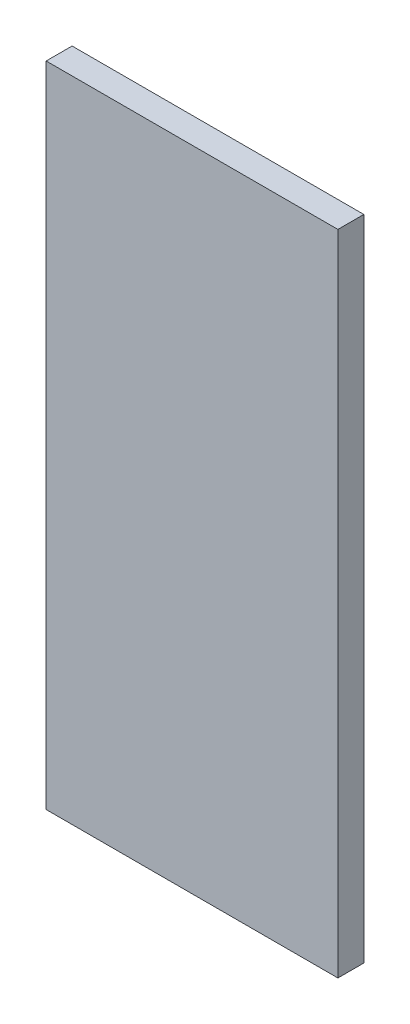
ISO-10303-21;
HEADER;
FILE_DESCRIPTION(('STEP AP214'),'2;1');
FILE_NAME('part.step','',(''),(''),'','','');
FILE_SCHEMA(('AUTOMOTIVE_DESIGN { 1 0 10303 214 1 1 1 1 }'));
ENDSEC;
DATA;
#1=APPLICATION_CONTEXT('core data for automotive mechanical design processes');
#2=APPLICATION_PROTOCOL_DEFINITION('international standard','automotive_design',2000,#1);
#3=PRODUCT_CONTEXT('',#1,'mechanical');
#4=PRODUCT('Part','Part','',(#3));
#5=PRODUCT_RELATED_PRODUCT_CATEGORY('part','',(#4));
#6=PRODUCT_DEFINITION_FORMATION('','',#4);
#7=PRODUCT_DEFINITION_CONTEXT('part definition',#1,'design');
#8=PRODUCT_DEFINITION('design','',#6,#7);
#9=PRODUCT_DEFINITION_SHAPE('','',#8);
#10=(LENGTH_UNIT() NAMED_UNIT(*) SI_UNIT(.MILLI.,.METRE.));
#11=(NAMED_UNIT(*) PLANE_ANGLE_UNIT() SI_UNIT($,.RADIAN.));
#12=(NAMED_UNIT(*) SI_UNIT($,.STERADIAN.) SOLID_ANGLE_UNIT());
#13=UNCERTAINTY_MEASURE_WITH_UNIT(LENGTH_MEASURE(1.E-05),#10,'distance_accuracy_value','');
#14=(GEOMETRIC_REPRESENTATION_CONTEXT(3) GLOBAL_UNCERTAINTY_ASSIGNED_CONTEXT((#13)) GLOBAL_UNIT_ASSIGNED_CONTEXT((#10,
#11,#12)) REPRESENTATION_CONTEXT('',''));
#15=CARTESIAN_POINT('',(0.,0.,0.));
#16=DIRECTION('',(0.,0.,1.));
#17=DIRECTION('',(1.,0.,0.));
#18=AXIS2_PLACEMENT_3D('',#15,#16,#17);
#19=CARTESIAN_POINT('',(-1.66533453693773E-13,2.22044604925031E-13,8.00000000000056));
#20=DIRECTION('',(1.,0.,0.));
#21=DIRECTION('',(0.,0.,-1.));
#22=AXIS2_PLACEMENT_3D('',#19,#20,#21);
#23=PLANE('',#22);
#24=DIRECTION('',(0.,-1.,0.));
#25=VECTOR('',#24,1.);
#26=CARTESIAN_POINT('',(-1.66533453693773E-13,0.,0.));
#27=LINE('',#26,#25);
#28=CARTESIAN_POINT('',(-1.66533453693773E-13,200.,0.));
#29=VERTEX_POINT('',#28);
#30=CARTESIAN_POINT('',(-1.66533453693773E-13,0.,0.));
#31=VERTEX_POINT('',#30);
#32=EDGE_CURVE('E85',#29,#31,#27,.T.);
#33=ORIENTED_EDGE('',*,*,#32,.T.);
#34=DIRECTION('',(0.,0.,-1.));
#35=VECTOR('',#34,1.);
#36=CARTESIAN_POINT('',(-1.66533453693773E-13,2.22044604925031E-13,8.00000000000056));
#37=LINE('',#36,#35);
#38=CARTESIAN_POINT('',(-1.66533453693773E-13,2.22044604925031E-13,8.00000000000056));
#39=VERTEX_POINT('',#38);
#40=EDGE_CURVE('E11',#39,#31,#37,.T.);
#41=ORIENTED_EDGE('',*,*,#40,.F.);
#42=DIRECTION('',(0.,-1.,0.));
#43=VECTOR('',#42,1.);
#44=CARTESIAN_POINT('',(-1.66533453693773E-13,2.22044604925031E-13,8.00000000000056));
#45=LINE('',#44,#43);
#46=CARTESIAN_POINT('',(-1.66533453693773E-13,200.,8.00000000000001));
#47=VERTEX_POINT('',#46);
#48=EDGE_CURVE('E103',#47,#39,#45,.T.);
#49=ORIENTED_EDGE('',*,*,#48,.F.);
#50=DIRECTION('',(0.,0.,-1.));
#51=VECTOR('',#50,1.);
#52=CARTESIAN_POINT('',(-1.66533453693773E-13,200.,8.00000000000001));
#53=LINE('',#52,#51);
#54=EDGE_CURVE('E97',#47,#29,#53,.T.);
#55=ORIENTED_EDGE('',*,*,#54,.T.);
#56=EDGE_LOOP('',(#33,#41,#49,#55));
#57=FACE_BOUND('',#56,.T.);
#58=ADVANCED_FACE('F41',(#57),#23,.F.);
#59=CARTESIAN_POINT('',(-1.66533453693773E-13,2.22044604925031E-13,8.00000000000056));
#60=DIRECTION('',(0.,1.,0.));
#61=DIRECTION('',(0.,0.,1.));
#62=AXIS2_PLACEMENT_3D('',#59,#60,#61);
#63=PLANE('',#62);
#64=DIRECTION('',(1.,0.,0.));
#65=VECTOR('',#64,1.);
#66=CARTESIAN_POINT('',(-1.66533453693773E-13,0.,0.));
#67=LINE('',#66,#65);
#68=CARTESIAN_POINT('',(90.,0.,0.));
#69=VERTEX_POINT('',#68);
#70=EDGE_CURVE('E81',#31,#69,#67,.T.);
#71=ORIENTED_EDGE('',*,*,#70,.T.);
#72=DIRECTION('',(0.,0.,-1.));
#73=VECTOR('',#72,1.);
#74=CARTESIAN_POINT('',(90.,1.38777878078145E-13,7.9999999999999));
#75=LINE('',#74,#73);
#76=CARTESIAN_POINT('',(90.,1.38777878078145E-13,7.9999999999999));
#77=VERTEX_POINT('',#76);
#78=EDGE_CURVE('E48',#77,#69,#75,.T.);
#79=ORIENTED_EDGE('',*,*,#78,.F.);
#80=DIRECTION('',(1.,0.,0.));
#81=VECTOR('',#80,1.);
#82=CARTESIAN_POINT('',(-1.66533453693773E-13,2.22044604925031E-13,8.00000000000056));
#83=LINE('',#82,#81);
#84=EDGE_CURVE('E93',#39,#77,#83,.T.);
#85=ORIENTED_EDGE('',*,*,#84,.F.);
#86=ORIENTED_EDGE('',*,*,#40,.T.);
#87=EDGE_LOOP('',(#71,#79,#85,#86));
#88=FACE_BOUND('',#87,.T.);
#89=ADVANCED_FACE('F92',(#88),#63,.F.);
#90=CARTESIAN_POINT('',(90.,1.38777878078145E-13,7.9999999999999));
#91=DIRECTION('',(-1.,0.,0.));
#92=DIRECTION('',(0.,0.,1.));
#93=AXIS2_PLACEMENT_3D('',#90,#91,#92);
#94=PLANE('',#93);
#95=DIRECTION('',(0.,1.,0.));
#96=VECTOR('',#95,1.);
#97=CARTESIAN_POINT('',(90.,0.,0.));
#98=LINE('',#97,#96);
#99=CARTESIAN_POINT('',(90.,200.,2.22044604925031E-13));
#100=VERTEX_POINT('',#99);
#101=EDGE_CURVE('E86',#69,#100,#98,.T.);
#102=ORIENTED_EDGE('',*,*,#101,.T.);
#103=DIRECTION('',(0.,0.,-1.));
#104=VECTOR('',#103,1.);
#105=CARTESIAN_POINT('',(90.,200.,8.00000000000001));
#106=LINE('',#105,#104);
#107=CARTESIAN_POINT('',(90.,200.,8.00000000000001));
#108=VERTEX_POINT('',#107);
#109=EDGE_CURVE('E109',#108,#100,#106,.T.);
#110=ORIENTED_EDGE('',*,*,#109,.F.);
#111=DIRECTION('',(0.,1.,0.));
#112=VECTOR('',#111,1.);
#113=CARTESIAN_POINT('',(90.,1.38777878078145E-13,7.9999999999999));
#114=LINE('',#113,#112);
#115=EDGE_CURVE('E60',#77,#108,#114,.T.);
#116=ORIENTED_EDGE('',*,*,#115,.F.);
#117=ORIENTED_EDGE('',*,*,#78,.T.);
#118=EDGE_LOOP('',(#102,#110,#116,#117));
#119=FACE_BOUND('',#118,.T.);
#120=ADVANCED_FACE('F112',(#119),#94,.F.);
#121=CARTESIAN_POINT('',(-1.66533453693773E-13,200.,8.00000000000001));
#122=DIRECTION('',(0.,-1.,0.));
#123=DIRECTION('',(0.,0.,-1.));
#124=AXIS2_PLACEMENT_3D('',#121,#122,#123);
#125=PLANE('',#124);
#126=DIRECTION('',(-1.,0.,0.));
#127=VECTOR('',#126,1.);
#128=CARTESIAN_POINT('',(-1.66533453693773E-13,200.,0.));
#129=LINE('',#128,#127);
#130=EDGE_CURVE('E101',#100,#29,#129,.T.);
#131=ORIENTED_EDGE('',*,*,#130,.T.);
#132=ORIENTED_EDGE('',*,*,#54,.F.);
#133=DIRECTION('',(-1.,0.,0.));
#134=VECTOR('',#133,1.);
#135=CARTESIAN_POINT('',(-1.66533453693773E-13,200.,8.00000000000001));
#136=LINE('',#135,#134);
#137=EDGE_CURVE('E55',#108,#47,#136,.T.);
#138=ORIENTED_EDGE('',*,*,#137,.F.);
#139=ORIENTED_EDGE('',*,*,#109,.T.);
#140=EDGE_LOOP('',(#131,#132,#138,#139));
#141=FACE_BOUND('',#140,.T.);
#142=ADVANCED_FACE('F114',(#141),#125,.F.);
#143=CARTESIAN_POINT('',(-1.66533453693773E-13,200.,8.00000000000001));
#144=DIRECTION('',(0.,0.,-1.));
#145=DIRECTION('',(-1.,0.,0.));
#146=AXIS2_PLACEMENT_3D('',#143,#144,#145);
#147=PLANE('',#146);
#148=ORIENTED_EDGE('',*,*,#48,.T.);
#149=ORIENTED_EDGE('',*,*,#84,.T.);
#150=ORIENTED_EDGE('',*,*,#115,.T.);
#151=ORIENTED_EDGE('',*,*,#137,.T.);
#152=EDGE_LOOP('',(#148,#149,#150,#151));
#153=FACE_BOUND('',#152,.T.);
#154=ADVANCED_FACE('F115',(#153),#147,.F.);
#155=CARTESIAN_POINT('',(-1.66533453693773E-13,200.,0.));
#156=DIRECTION('',(0.,0.,-1.));
#157=DIRECTION('',(-1.,0.,0.));
#158=AXIS2_PLACEMENT_3D('',#155,#156,#157);
#159=PLANE('',#158);
#160=ORIENTED_EDGE('',*,*,#32,.F.);
#161=ORIENTED_EDGE('',*,*,#130,.F.);
#162=ORIENTED_EDGE('',*,*,#101,.F.);
#163=ORIENTED_EDGE('',*,*,#70,.F.);
#164=EDGE_LOOP('',(#160,#161,#162,#163));
#165=FACE_BOUND('',#164,.T.);
#166=ADVANCED_FACE('F82',(#165),#159,.T.);
#167=CLOSED_SHELL('',(#58,#89,#120,#142,#154,#166));
#168=MANIFOLD_SOLID_BREP('B2',#167);
#169=ADVANCED_BREP_SHAPE_REPRESENTATION('',(#18,#168),#14);
#170=SHAPE_DEFINITION_REPRESENTATION(#9,#169);
ENDSEC;
END-ISO-10303-21;
